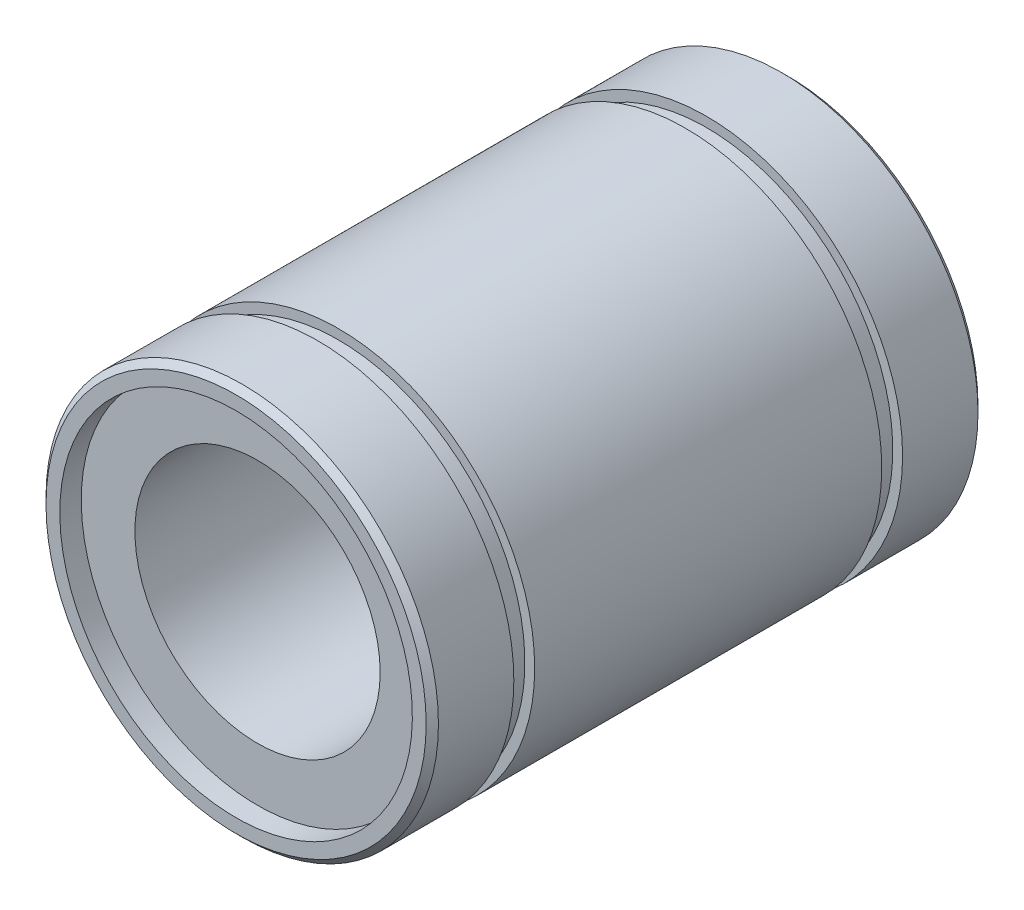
ISO-10303-21;
HEADER;
FILE_DESCRIPTION(('STEP AP214'),'2;1');
FILE_NAME('part.step','',(''),(''),'','','');
FILE_SCHEMA(('AUTOMOTIVE_DESIGN { 1 0 10303 214 1 1 1 1 }'));
ENDSEC;
DATA;
#1=APPLICATION_CONTEXT('core data for automotive mechanical design processes');
#2=APPLICATION_PROTOCOL_DEFINITION('international standard','automotive_design',2000,#1);
#3=PRODUCT_CONTEXT('',#1,'mechanical');
#4=PRODUCT('Part','Part','',(#3));
#5=PRODUCT_RELATED_PRODUCT_CATEGORY('part','',(#4));
#6=PRODUCT_DEFINITION_FORMATION('','',#4);
#7=PRODUCT_DEFINITION_CONTEXT('part definition',#1,'design');
#8=PRODUCT_DEFINITION('design','',#6,#7);
#9=PRODUCT_DEFINITION_SHAPE('','',#8);
#10=(LENGTH_UNIT() NAMED_UNIT(*) SI_UNIT(.MILLI.,.METRE.));
#11=(NAMED_UNIT(*) PLANE_ANGLE_UNIT() SI_UNIT($,.RADIAN.));
#12=(NAMED_UNIT(*) SI_UNIT($,.STERADIAN.) SOLID_ANGLE_UNIT());
#13=UNCERTAINTY_MEASURE_WITH_UNIT(LENGTH_MEASURE(1.E-05),#10,'distance_accuracy_value','');
#14=(GEOMETRIC_REPRESENTATION_CONTEXT(3) GLOBAL_UNCERTAINTY_ASSIGNED_CONTEXT((#13)) GLOBAL_UNIT_ASSIGNED_CONTEXT((#10,
#11,#12)) REPRESENTATION_CONTEXT('',''));
#15=CARTESIAN_POINT('',(0.,0.,0.));
#16=DIRECTION('',(0.,0.,1.));
#17=DIRECTION('',(1.,0.,0.));
#18=AXIS2_PLACEMENT_3D('',#15,#16,#17);
#19=CARTESIAN_POINT('',(0.,0.,0.));
#20=DIRECTION('',(0.,0.,1.));
#21=DIRECTION('',(1.,0.,0.));
#22=AXIS2_PLACEMENT_3D('',#19,#20,#21);
#23=CYLINDRICAL_SURFACE('',#22,10.);
#24=CARTESIAN_POINT('',(0.,0.,-20.75));
#25=DIRECTION('',(0.,0.,1.));
#26=DIRECTION('',(1.,0.,0.));
#27=AXIS2_PLACEMENT_3D('',#24,#25,#26);
#28=CIRCLE('',#27,10.);
#29=CARTESIAN_POINT('',(10.,0.,-20.75));
#30=VERTEX_POINT('',#29);
#31=EDGE_CURVE('E18',#30,#30,#28,.F.);
#32=ORIENTED_EDGE('',*,*,#31,.T.);
#33=EDGE_LOOP('',(#32));
#34=FACE_BOUND('',#33,.T.);
#35=CARTESIAN_POINT('',(0.,0.,20.75));
#36=DIRECTION('',(0.,0.,1.));
#37=DIRECTION('',(1.,0.,0.));
#38=AXIS2_PLACEMENT_3D('',#35,#36,#37);
#39=CIRCLE('',#38,10.);
#40=CARTESIAN_POINT('',(10.,0.,20.75));
#41=VERTEX_POINT('',#40);
#42=EDGE_CURVE('E69',#41,#41,#39,.T.);
#43=ORIENTED_EDGE('',*,*,#42,.T.);
#44=EDGE_LOOP('',(#43));
#45=FACE_BOUND('',#44,.T.);
#46=ADVANCED_FACE('F14',(#34,#45),#23,.F.);
#47=CARTESIAN_POINT('',(0.,0.,-20.75));
#48=DIRECTION('',(0.,0.,1.));
#49=DIRECTION('',(1.,0.,0.));
#50=AXIS2_PLACEMENT_3D('',#47,#48,#49);
#51=PLANE('',#50);
#52=ORIENTED_EDGE('',*,*,#31,.F.);
#53=EDGE_LOOP('',(#52));
#54=FACE_BOUND('',#53,.T.);
#55=CARTESIAN_POINT('',(0.,0.,-20.75));
#56=DIRECTION('',(0.,0.,1.));
#57=DIRECTION('',(1.,0.,0.));
#58=AXIS2_PLACEMENT_3D('',#55,#56,#57);
#59=CIRCLE('',#58,14.375);
#60=CARTESIAN_POINT('',(14.375,0.,-20.75));
#61=VERTEX_POINT('',#60);
#62=EDGE_CURVE('E67',#61,#61,#59,.F.);
#63=ORIENTED_EDGE('',*,*,#62,.T.);
#64=EDGE_LOOP('',(#63));
#65=FACE_BOUND('',#64,.T.);
#66=ADVANCED_FACE('F77',(#54,#65),#51,.F.);
#67=CARTESIAN_POINT('',(-14.6625,14.6625,20.75));
#68=DIRECTION('',(0.,0.,-1.));
#69=DIRECTION('',(1.,0.,0.));
#70=AXIS2_PLACEMENT_3D('',#67,#68,#69);
#71=PLANE('',#70);
#72=ORIENTED_EDGE('',*,*,#42,.F.);
#73=EDGE_LOOP('',(#72));
#74=FACE_BOUND('',#73,.T.);
#75=CARTESIAN_POINT('',(0.,0.,20.75));
#76=DIRECTION('',(0.,0.,-1.));
#77=DIRECTION('',(0.,1.,0.));
#78=AXIS2_PLACEMENT_3D('',#75,#76,#77);
#79=CIRCLE('',#78,14.375);
#80=CARTESIAN_POINT('',(0.,14.375,20.75));
#81=VERTEX_POINT('',#80);
#82=EDGE_CURVE('E64',#81,#81,#79,.F.);
#83=ORIENTED_EDGE('',*,*,#82,.T.);
#84=EDGE_LOOP('',(#83));
#85=FACE_BOUND('',#84,.T.);
#86=ADVANCED_FACE('F80',(#74,#85),#71,.F.);
#87=CARTESIAN_POINT('',(0.,0.,-22.5));
#88=DIRECTION('',(0.,0.,1.));
#89=DIRECTION('',(1.,0.,0.));
#90=AXIS2_PLACEMENT_3D('',#87,#88,#89);
#91=CYLINDRICAL_SURFACE('',#90,14.375);
#92=CARTESIAN_POINT('',(0.,0.,-22.5));
#93=DIRECTION('',(0.,0.,1.));
#94=DIRECTION('',(1.,0.,0.));
#95=AXIS2_PLACEMENT_3D('',#92,#93,#94);
#96=CIRCLE('',#95,14.375);
#97=CARTESIAN_POINT('',(14.375,0.,-22.5));
#98=VERTEX_POINT('',#97);
#99=EDGE_CURVE('E61',#98,#98,#96,.T.);
#100=ORIENTED_EDGE('',*,*,#99,.F.);
#101=EDGE_LOOP('',(#100));
#102=FACE_BOUND('',#101,.T.);
#103=ORIENTED_EDGE('',*,*,#62,.F.);
#104=EDGE_LOOP('',(#103));
#105=FACE_BOUND('',#104,.T.);
#106=ADVANCED_FACE('F84',(#102,#105),#91,.F.);
#107=CARTESIAN_POINT('',(0.,0.,22.5));
#108=DIRECTION('',(0.,0.,-1.));
#109=DIRECTION('',(0.,1.,0.));
#110=AXIS2_PLACEMENT_3D('',#107,#108,#109);
#111=CYLINDRICAL_SURFACE('',#110,14.375);
#112=CARTESIAN_POINT('',(0.,0.,22.5));
#113=DIRECTION('',(0.,0.,-1.));
#114=DIRECTION('',(0.,1.,0.));
#115=AXIS2_PLACEMENT_3D('',#112,#113,#114);
#116=CIRCLE('',#115,14.375);
#117=CARTESIAN_POINT('',(0.,14.375,22.5));
#118=VERTEX_POINT('',#117);
#119=EDGE_CURVE('E58',#118,#118,#116,.F.);
#120=ORIENTED_EDGE('',*,*,#119,.T.);
#121=EDGE_LOOP('',(#120));
#122=FACE_BOUND('',#121,.T.);
#123=ORIENTED_EDGE('',*,*,#82,.F.);
#124=EDGE_LOOP('',(#123));
#125=FACE_BOUND('',#124,.T.);
#126=ADVANCED_FACE('F16',(#122,#125),#111,.F.);
#127=CARTESIAN_POINT('',(0.,0.,-22.5));
#128=DIRECTION('',(0.,0.,-1.));
#129=DIRECTION('',(-1.,0.,0.));
#130=AXIS2_PLACEMENT_3D('',#127,#128,#129);
#131=PLANE('',#130);
#132=ORIENTED_EDGE('',*,*,#99,.T.);
#133=EDGE_LOOP('',(#132));
#134=FACE_BOUND('',#133,.T.);
#135=CARTESIAN_POINT('',(0.,0.,-22.5000000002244));
#136=DIRECTION('',(0.,0.,1.));
#137=DIRECTION('',(1.,0.,0.));
#138=AXIS2_PLACEMENT_3D('',#135,#136,#137);
#139=CIRCLE('',#138,15.5000000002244);
#140=CARTESIAN_POINT('',(15.5000000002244,0.,-22.5000000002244));
#141=VERTEX_POINT('',#140);
#142=EDGE_CURVE('E55',#141,#141,#139,.T.);
#143=ORIENTED_EDGE('',*,*,#142,.F.);
#144=EDGE_LOOP('',(#143));
#145=FACE_BOUND('',#144,.T.);
#146=ADVANCED_FACE('F93',(#134,#145),#131,.T.);
#147=CARTESIAN_POINT('',(0.,0.,22.5));
#148=DIRECTION('',(0.,0.,-1.));
#149=DIRECTION('',(-1.,0.,0.));
#150=AXIS2_PLACEMENT_3D('',#147,#148,#149);
#151=PLANE('',#150);
#152=ORIENTED_EDGE('',*,*,#119,.F.);
#153=EDGE_LOOP('',(#152));
#154=FACE_BOUND('',#153,.T.);
#155=CARTESIAN_POINT('',(0.,0.,22.5000000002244));
#156=DIRECTION('',(0.,0.,-1.));
#157=DIRECTION('',(-1.,0.,0.));
#158=AXIS2_PLACEMENT_3D('',#155,#156,#157);
#159=CIRCLE('',#158,15.5000000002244);
#160=CARTESIAN_POINT('',(-15.5000000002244,0.,22.5000000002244));
#161=VERTEX_POINT('',#160);
#162=EDGE_CURVE('E51',#161,#161,#159,.T.);
#163=ORIENTED_EDGE('',*,*,#162,.F.);
#164=EDGE_LOOP('',(#163));
#165=FACE_BOUND('',#164,.T.);
#166=ADVANCED_FACE('F144',(#154,#165),#151,.F.);
#167=CARTESIAN_POINT('',(0.,0.,-21.9999999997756));
#168=DIRECTION('',(0.,0.,1.));
#169=DIRECTION('',(1.,0.,0.));
#170=AXIS2_PLACEMENT_3D('',#167,#168,#169);
#171=CONICAL_SURFACE('',#170,15.9999999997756,0.785398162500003);
#172=CARTESIAN_POINT('',(0.,0.,-22.));
#173=DIRECTION('',(0.,0.,1.));
#174=DIRECTION('',(1.,0.,0.));
#175=AXIS2_PLACEMENT_3D('',#172,#173,#174);
#176=CIRCLE('',#175,16.);
#177=CARTESIAN_POINT('',(16.,0.,-22.));
#178=VERTEX_POINT('',#177);
#179=EDGE_CURVE('E54',#178,#178,#176,.T.);
#180=ORIENTED_EDGE('',*,*,#179,.F.);
#181=EDGE_LOOP('',(#180));
#182=FACE_BOUND('',#181,.T.);
#183=ORIENTED_EDGE('',*,*,#142,.T.);
#184=EDGE_LOOP('',(#183));
#185=FACE_BOUND('',#184,.T.);
#186=ADVANCED_FACE('F140',(#182,#185),#171,.T.);
#187=CARTESIAN_POINT('',(0.,0.,21.9999999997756));
#188=DIRECTION('',(0.,0.,-1.));
#189=DIRECTION('',(-1.,0.,0.));
#190=AXIS2_PLACEMENT_3D('',#187,#188,#189);
#191=CONICAL_SURFACE('',#190,15.9999999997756,0.785398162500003);
#192=CARTESIAN_POINT('',(0.,0.,22.));
#193=DIRECTION('',(0.,0.,1.));
#194=DIRECTION('',(1.,0.,0.));
#195=AXIS2_PLACEMENT_3D('',#192,#193,#194);
#196=CIRCLE('',#195,16.);
#197=CARTESIAN_POINT('',(16.,0.,22.));
#198=VERTEX_POINT('',#197);
#199=EDGE_CURVE('E50',#198,#198,#196,.F.);
#200=ORIENTED_EDGE('',*,*,#199,.F.);
#201=EDGE_LOOP('',(#200));
#202=FACE_BOUND('',#201,.T.);
#203=ORIENTED_EDGE('',*,*,#162,.T.);
#204=EDGE_LOOP('',(#203));
#205=FACE_BOUND('',#204,.T.);
#206=ADVANCED_FACE('F136',(#202,#205),#191,.T.);
#207=CARTESIAN_POINT('',(0.,0.,0.));
#208=DIRECTION('',(0.,0.,1.));
#209=DIRECTION('',(1.,0.,0.));
#210=AXIS2_PLACEMENT_3D('',#207,#208,#209);
#211=CYLINDRICAL_SURFACE('',#210,16.);
#212=ORIENTED_EDGE('',*,*,#179,.T.);
#213=EDGE_LOOP('',(#212));
#214=FACE_BOUND('',#213,.T.);
#215=CARTESIAN_POINT('',(0.,0.,-15.85));
#216=DIRECTION('',(0.,0.,1.));
#217=DIRECTION('',(1.,0.,0.));
#218=AXIS2_PLACEMENT_3D('',#215,#216,#217);
#219=CIRCLE('',#218,16.);
#220=CARTESIAN_POINT('',(16.,0.,-15.85));
#221=VERTEX_POINT('',#220);
#222=EDGE_CURVE('E47',#221,#221,#219,.F.);
#223=ORIENTED_EDGE('',*,*,#222,.T.);
#224=EDGE_LOOP('',(#223));
#225=FACE_BOUND('',#224,.T.);
#226=ADVANCED_FACE('F132',(#214,#225),#211,.T.);
#227=CARTESIAN_POINT('',(0.,0.,0.));
#228=DIRECTION('',(0.,0.,1.));
#229=DIRECTION('',(1.,0.,0.));
#230=AXIS2_PLACEMENT_3D('',#227,#228,#229);
#231=CYLINDRICAL_SURFACE('',#230,16.);
#232=ORIENTED_EDGE('',*,*,#199,.T.);
#233=EDGE_LOOP('',(#232));
#234=FACE_BOUND('',#233,.T.);
#235=CARTESIAN_POINT('',(0.,0.,15.85));
#236=DIRECTION('',(0.,0.,1.));
#237=DIRECTION('',(1.,0.,0.));
#238=AXIS2_PLACEMENT_3D('',#235,#236,#237);
#239=CIRCLE('',#238,16.);
#240=CARTESIAN_POINT('',(16.,0.,15.85));
#241=VERTEX_POINT('',#240);
#242=EDGE_CURVE('E44',#241,#241,#239,.T.);
#243=ORIENTED_EDGE('',*,*,#242,.T.);
#244=EDGE_LOOP('',(#243));
#245=FACE_BOUND('',#244,.T.);
#246=ADVANCED_FACE('F128',(#234,#245),#231,.T.);
#247=CARTESIAN_POINT('',(0.,-15.6,-15.85));
#248=DIRECTION('',(0.,0.,-1.));
#249=DIRECTION('',(-1.,0.,0.));
#250=AXIS2_PLACEMENT_3D('',#247,#248,#249);
#251=PLANE('',#250);
#252=CARTESIAN_POINT('',(0.,0.,-15.85));
#253=DIRECTION('',(0.,0.,-1.));
#254=DIRECTION('',(-1.,0.,0.));
#255=AXIS2_PLACEMENT_3D('',#252,#253,#254);
#256=CIRCLE('',#255,15.2);
#257=CARTESIAN_POINT('',(-15.2,0.,-15.85));
#258=VERTEX_POINT('',#257);
#259=EDGE_CURVE('E41',#258,#258,#256,.F.);
#260=ORIENTED_EDGE('',*,*,#259,.F.);
#261=EDGE_LOOP('',(#260));
#262=FACE_BOUND('',#261,.T.);
#263=ORIENTED_EDGE('',*,*,#222,.F.);
#264=EDGE_LOOP('',(#263));
#265=FACE_BOUND('',#264,.T.);
#266=ADVANCED_FACE('F124',(#262,#265),#251,.F.);
#267=CARTESIAN_POINT('',(0.,-15.6,15.85));
#268=DIRECTION('',(0.,0.,1.));
#269=DIRECTION('',(1.,0.,0.));
#270=AXIS2_PLACEMENT_3D('',#267,#268,#269);
#271=PLANE('',#270);
#272=CARTESIAN_POINT('',(0.,0.,15.85));
#273=DIRECTION('',(0.,0.,-1.));
#274=DIRECTION('',(-1.,0.,0.));
#275=AXIS2_PLACEMENT_3D('',#272,#273,#274);
#276=CIRCLE('',#275,15.2);
#277=CARTESIAN_POINT('',(-15.2,0.,15.85));
#278=VERTEX_POINT('',#277);
#279=EDGE_CURVE('E38',#278,#278,#276,.T.);
#280=ORIENTED_EDGE('',*,*,#279,.F.);
#281=EDGE_LOOP('',(#280));
#282=FACE_BOUND('',#281,.T.);
#283=ORIENTED_EDGE('',*,*,#242,.F.);
#284=EDGE_LOOP('',(#283));
#285=FACE_BOUND('',#284,.T.);
#286=ADVANCED_FACE('F120',(#282,#285),#271,.F.);
#287=CARTESIAN_POINT('',(0.,0.,-15.));
#288=DIRECTION('',(0.,0.,-1.));
#289=DIRECTION('',(-1.,0.,0.));
#290=AXIS2_PLACEMENT_3D('',#287,#288,#289);
#291=CYLINDRICAL_SURFACE('',#290,15.2);
#292=ORIENTED_EDGE('',*,*,#259,.T.);
#293=EDGE_LOOP('',(#292));
#294=FACE_BOUND('',#293,.T.);
#295=CARTESIAN_POINT('',(0.,0.,-14.15));
#296=DIRECTION('',(0.,0.,-1.));
#297=DIRECTION('',(-1.,0.,0.));
#298=AXIS2_PLACEMENT_3D('',#295,#296,#297);
#299=CIRCLE('',#298,15.2);
#300=CARTESIAN_POINT('',(-15.2,0.,-14.15));
#301=VERTEX_POINT('',#300);
#302=EDGE_CURVE('E35',#301,#301,#299,.T.);
#303=ORIENTED_EDGE('',*,*,#302,.T.);
#304=EDGE_LOOP('',(#303));
#305=FACE_BOUND('',#304,.T.);
#306=ADVANCED_FACE('F116',(#294,#305),#291,.T.);
#307=CARTESIAN_POINT('',(0.,0.,15.));
#308=DIRECTION('',(0.,0.,-1.));
#309=DIRECTION('',(-1.,0.,0.));
#310=AXIS2_PLACEMENT_3D('',#307,#308,#309);
#311=CYLINDRICAL_SURFACE('',#310,15.2);
#312=CARTESIAN_POINT('',(0.,0.,14.15));
#313=DIRECTION('',(0.,0.,-1.));
#314=DIRECTION('',(-1.,0.,0.));
#315=AXIS2_PLACEMENT_3D('',#312,#313,#314);
#316=CIRCLE('',#315,15.2);
#317=CARTESIAN_POINT('',(-15.2,0.,14.15));
#318=VERTEX_POINT('',#317);
#319=EDGE_CURVE('E27',#318,#318,#316,.F.);
#320=ORIENTED_EDGE('',*,*,#319,.T.);
#321=EDGE_LOOP('',(#320));
#322=FACE_BOUND('',#321,.T.);
#323=ORIENTED_EDGE('',*,*,#279,.T.);
#324=EDGE_LOOP('',(#323));
#325=FACE_BOUND('',#324,.T.);
#326=ADVANCED_FACE('F112',(#322,#325),#311,.T.);
#327=CARTESIAN_POINT('',(0.,-15.6,-14.15));
#328=DIRECTION('',(0.,0.,1.));
#329=DIRECTION('',(1.,0.,0.));
#330=AXIS2_PLACEMENT_3D('',#327,#328,#329);
#331=PLANE('',#330);
#332=ORIENTED_EDGE('',*,*,#302,.F.);
#333=EDGE_LOOP('',(#332));
#334=FACE_BOUND('',#333,.T.);
#335=CARTESIAN_POINT('',(0.,0.,-14.15));
#336=DIRECTION('',(0.,0.,1.));
#337=DIRECTION('',(1.,0.,0.));
#338=AXIS2_PLACEMENT_3D('',#335,#336,#337);
#339=CIRCLE('',#338,16.);
#340=CARTESIAN_POINT('',(16.,0.,-14.15));
#341=VERTEX_POINT('',#340);
#342=EDGE_CURVE('E22',#341,#341,#339,.T.);
#343=ORIENTED_EDGE('',*,*,#342,.F.);
#344=EDGE_LOOP('',(#343));
#345=FACE_BOUND('',#344,.T.);
#346=ADVANCED_FACE('F105',(#334,#345),#331,.F.);
#347=CARTESIAN_POINT('',(0.,-15.6,14.15));
#348=DIRECTION('',(0.,0.,-1.));
#349=DIRECTION('',(-1.,0.,0.));
#350=AXIS2_PLACEMENT_3D('',#347,#348,#349);
#351=PLANE('',#350);
#352=ORIENTED_EDGE('',*,*,#319,.F.);
#353=EDGE_LOOP('',(#352));
#354=FACE_BOUND('',#353,.T.);
#355=CARTESIAN_POINT('',(0.,0.,14.15));
#356=DIRECTION('',(0.,0.,1.));
#357=DIRECTION('',(1.,0.,0.));
#358=AXIS2_PLACEMENT_3D('',#355,#356,#357);
#359=CIRCLE('',#358,16.);
#360=CARTESIAN_POINT('',(16.,0.,14.15));
#361=VERTEX_POINT('',#360);
#362=EDGE_CURVE('E10',#361,#361,#359,.F.);
#363=ORIENTED_EDGE('',*,*,#362,.F.);
#364=EDGE_LOOP('',(#363));
#365=FACE_BOUND('',#364,.T.);
#366=ADVANCED_FACE('F100',(#354,#365),#351,.F.);
#367=CARTESIAN_POINT('',(0.,0.,0.));
#368=DIRECTION('',(0.,0.,1.));
#369=DIRECTION('',(1.,0.,0.));
#370=AXIS2_PLACEMENT_3D('',#367,#368,#369);
#371=CYLINDRICAL_SURFACE('',#370,16.);
#372=ORIENTED_EDGE('',*,*,#362,.T.);
#373=EDGE_LOOP('',(#372));
#374=FACE_BOUND('',#373,.T.);
#375=ORIENTED_EDGE('',*,*,#342,.T.);
#376=EDGE_LOOP('',(#375));
#377=FACE_BOUND('',#376,.T.);
#378=ADVANCED_FACE('F98',(#374,#377),#371,.T.);
#379=CLOSED_SHELL('',(#46,#66,#86,#106,#126,#146,#166,#186,#206,#226,#246,#266,#286,#306,#326,
#346,#366,#378));
#380=MANIFOLD_SOLID_BREP('B1',#379);
#381=ADVANCED_BREP_SHAPE_REPRESENTATION('',(#18,#380),#14);
#382=SHAPE_DEFINITION_REPRESENTATION(#9,#381);
ENDSEC;
END-ISO-10303-21;
